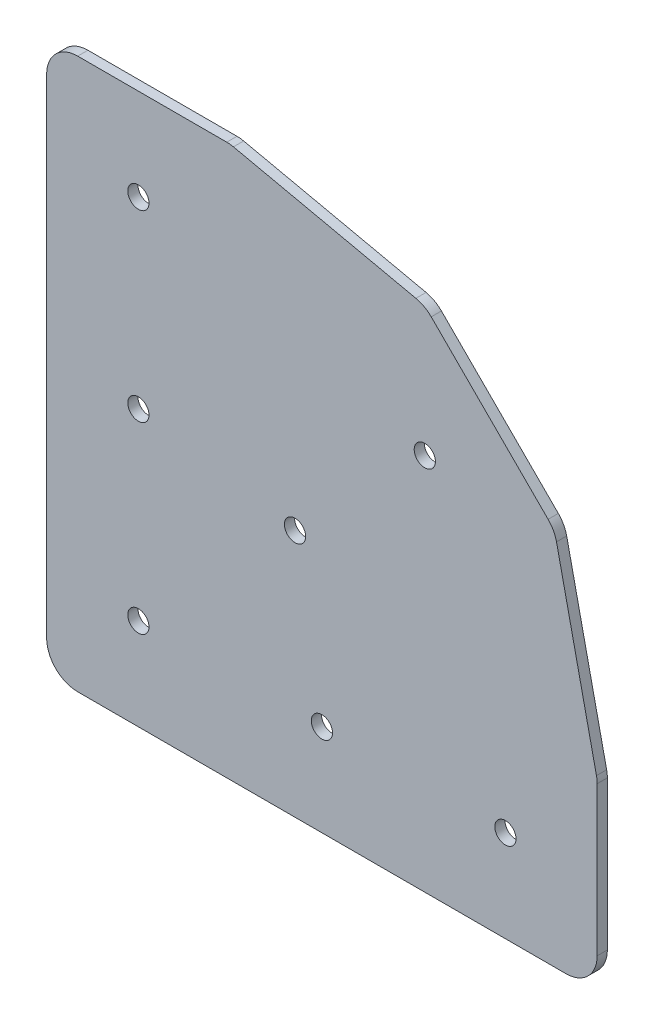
ISO-10303-21;
HEADER;
FILE_DESCRIPTION(('STEP AP214'),'2;1');
FILE_NAME('part.step','',(''),(''),'','','');
FILE_SCHEMA(('AUTOMOTIVE_DESIGN { 1 0 10303 214 1 1 1 1 }'));
ENDSEC;
DATA;
#1=APPLICATION_CONTEXT('core data for automotive mechanical design processes');
#2=APPLICATION_PROTOCOL_DEFINITION('international standard','automotive_design',2000,#1);
#3=PRODUCT_CONTEXT('',#1,'mechanical');
#4=PRODUCT('Part','Part','',(#3));
#5=PRODUCT_RELATED_PRODUCT_CATEGORY('part','',(#4));
#6=PRODUCT_DEFINITION_FORMATION('','',#4);
#7=PRODUCT_DEFINITION_CONTEXT('part definition',#1,'design');
#8=PRODUCT_DEFINITION('design','',#6,#7);
#9=PRODUCT_DEFINITION_SHAPE('','',#8);
#10=(LENGTH_UNIT() NAMED_UNIT(*) SI_UNIT(.MILLI.,.METRE.));
#11=(NAMED_UNIT(*) PLANE_ANGLE_UNIT() SI_UNIT($,.RADIAN.));
#12=(NAMED_UNIT(*) SI_UNIT($,.STERADIAN.) SOLID_ANGLE_UNIT());
#13=UNCERTAINTY_MEASURE_WITH_UNIT(LENGTH_MEASURE(1.E-05),#10,'distance_accuracy_value','');
#14=(GEOMETRIC_REPRESENTATION_CONTEXT(3) GLOBAL_UNCERTAINTY_ASSIGNED_CONTEXT((#13)) GLOBAL_UNIT_ASSIGNED_CONTEXT((#10,
#11,#12)) REPRESENTATION_CONTEXT('',''));
#15=CARTESIAN_POINT('',(0.,0.,0.));
#16=DIRECTION('',(0.,0.,1.));
#17=DIRECTION('',(1.,0.,0.));
#18=AXIS2_PLACEMENT_3D('',#15,#16,#17);
#19=CARTESIAN_POINT('',(4.841875,0.,0.));
#20=DIRECTION('',(0.,1.,0.));
#21=DIRECTION('',(0.,0.,1.));
#22=AXIS2_PLACEMENT_3D('',#19,#20,#21);
#23=PLANE('',#22);
#24=DIRECTION('',(0.,0.,-1.));
#25=VECTOR('',#24,1.);
#26=CARTESIAN_POINT('',(80.8831250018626,0.,0.79375));
#27=LINE('',#26,#25);
#28=CARTESIAN_POINT('',(80.8831250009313,0.,0.));
#29=VERTEX_POINT('',#28);
#30=CARTESIAN_POINT('',(80.8831250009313,0.,1.5875));
#31=VERTEX_POINT('',#30);
#32=EDGE_CURVE('E178',#29,#31,#27,.F.);
#33=ORIENTED_EDGE('',*,*,#32,.T.);
#34=DIRECTION('',(1.,0.,0.));
#35=VECTOR('',#34,1.);
#36=CARTESIAN_POINT('',(42.8625,0.,1.5875));
#37=LINE('',#36,#35);
#38=CARTESIAN_POINT('',(4.84187500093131,0.,1.5875));
#39=VERTEX_POINT('',#38);
#40=EDGE_CURVE('E222',#39,#31,#37,.T.);
#41=ORIENTED_EDGE('',*,*,#40,.F.);
#42=DIRECTION('',(0.,0.,1.));
#43=VECTOR('',#42,1.);
#44=CARTESIAN_POINT('',(4.84187500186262,0.,0.79375));
#45=LINE('',#44,#43);
#46=CARTESIAN_POINT('',(4.84187500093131,0.,0.));
#47=VERTEX_POINT('',#46);
#48=EDGE_CURVE('E142',#39,#47,#45,.F.);
#49=ORIENTED_EDGE('',*,*,#48,.T.);
#50=DIRECTION('',(1.,0.,0.));
#51=VECTOR('',#50,1.);
#52=CARTESIAN_POINT('',(42.8625,0.,0.));
#53=LINE('',#52,#51);
#54=EDGE_CURVE('E245',#47,#29,#53,.T.);
#55=ORIENTED_EDGE('',*,*,#54,.T.);
#56=EDGE_LOOP('',(#33,#41,#49,#55));
#57=FACE_BOUND('',#56,.T.);
#58=ADVANCED_FACE('F16',(#57),#23,.F.);
#59=CARTESIAN_POINT('',(80.883125,4.841875,1.5875));
#60=DIRECTION('',(0.,0.,-1.));
#61=DIRECTION('',(0.,1.,0.));
#62=AXIS2_PLACEMENT_3D('',#59,#60,#61);
#63=CYLINDRICAL_SURFACE('',#62,4.84187500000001);
#64=ORIENTED_EDGE('',*,*,#32,.F.);
#65=CARTESIAN_POINT('',(80.883125,4.841875,0.));
#66=DIRECTION('',(0.,0.,-1.));
#67=DIRECTION('',(0.,1.,0.));
#68=AXIS2_PLACEMENT_3D('',#65,#66,#67);
#69=CIRCLE('',#68,4.84187500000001);
#70=CARTESIAN_POINT('',(85.725,4.841875,0.));
#71=VERTEX_POINT('',#70);
#72=EDGE_CURVE('E242',#29,#71,#69,.F.);
#73=ORIENTED_EDGE('',*,*,#72,.T.);
#74=DIRECTION('',(0.,0.,1.));
#75=VECTOR('',#74,1.);
#76=CARTESIAN_POINT('',(85.725,4.841875,0.79375));
#77=LINE('',#76,#75);
#78=CARTESIAN_POINT('',(85.725,4.841875,1.5875));
#79=VERTEX_POINT('',#78);
#80=EDGE_CURVE('E175',#71,#79,#77,.T.);
#81=ORIENTED_EDGE('',*,*,#80,.T.);
#82=CARTESIAN_POINT('',(80.883125,4.841875,1.5875));
#83=DIRECTION('',(0.,0.,-1.));
#84=DIRECTION('',(0.,1.,0.));
#85=AXIS2_PLACEMENT_3D('',#82,#83,#84);
#86=CIRCLE('',#85,4.84187500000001);
#87=EDGE_CURVE('E220',#31,#79,#86,.F.);
#88=ORIENTED_EDGE('',*,*,#87,.F.);
#89=EDGE_LOOP('',(#64,#73,#81,#88));
#90=FACE_BOUND('',#89,.T.);
#91=ADVANCED_FACE('F360',(#90),#63,.T.);
#92=CARTESIAN_POINT('',(85.725,4.841875,0.));
#93=DIRECTION('',(-1.,0.,0.));
#94=DIRECTION('',(0.,0.,1.));
#95=AXIS2_PLACEMENT_3D('',#92,#93,#94);
#96=PLANE('',#95);
#97=ORIENTED_EDGE('',*,*,#80,.F.);
#98=DIRECTION('',(0.,1.,0.));
#99=VECTOR('',#98,1.);
#100=CARTESIAN_POINT('',(85.725,42.8625,0.));
#101=LINE('',#100,#99);
#102=CARTESIAN_POINT('',(85.725,28.0511372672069,0.));
#103=VERTEX_POINT('',#102);
#104=EDGE_CURVE('E241',#71,#103,#101,.T.);
#105=ORIENTED_EDGE('',*,*,#104,.T.);
#106=DIRECTION('',(0.,0.,-1.));
#107=VECTOR('',#106,1.);
#108=CARTESIAN_POINT('',(85.725,28.0511372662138,0.79375));
#109=LINE('',#108,#107);
#110=CARTESIAN_POINT('',(85.725,28.0511372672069,1.5875));
#111=VERTEX_POINT('',#110);
#112=EDGE_CURVE('E116',#103,#111,#109,.F.);
#113=ORIENTED_EDGE('',*,*,#112,.T.);
#114=DIRECTION('',(0.,1.,0.));
#115=VECTOR('',#114,1.);
#116=CARTESIAN_POINT('',(85.725,42.8625,1.5875));
#117=LINE('',#116,#115);
#118=EDGE_CURVE('E219',#79,#111,#117,.T.);
#119=ORIENTED_EDGE('',*,*,#118,.F.);
#120=EDGE_LOOP('',(#97,#105,#113,#119));
#121=FACE_BOUND('',#120,.T.);
#122=ADVANCED_FACE('F273',(#121),#96,.F.);
#123=CARTESIAN_POINT('',(80.883125,28.0511372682,1.5875));
#124=DIRECTION('',(0.,0.,-1.));
#125=DIRECTION('',(0.,1.,0.));
#126=AXIS2_PLACEMENT_3D('',#123,#124,#125);
#127=CYLINDRICAL_SURFACE('',#126,4.84187500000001);
#128=ORIENTED_EDGE('',*,*,#112,.F.);
#129=CARTESIAN_POINT('',(80.883125,28.0511372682,0.));
#130=DIRECTION('',(0.,0.,-1.));
#131=DIRECTION('',(0.,1.,0.));
#132=AXIS2_PLACEMENT_3D('',#129,#130,#131);
#133=CIRCLE('',#132,4.84187500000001);
#134=CARTESIAN_POINT('',(85.6129537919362,29.0867399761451,0.));
#135=VERTEX_POINT('',#134);
#136=EDGE_CURVE('E20',#103,#135,#133,.F.);
#137=ORIENTED_EDGE('',*,*,#136,.T.);
#138=DIRECTION('',(0.,0.,1.));
#139=VECTOR('',#138,1.);
#140=CARTESIAN_POINT('',(85.6129537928,29.0867399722,0.79375));
#141=LINE('',#140,#139);
#142=CARTESIAN_POINT('',(85.6129538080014,29.086739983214,1.5875));
#143=VERTEX_POINT('',#142);
#144=EDGE_CURVE('E123',#135,#143,#141,.T.);
#145=ORIENTED_EDGE('',*,*,#144,.T.);
#146=CARTESIAN_POINT('',(80.883125,28.0511372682,1.5875));
#147=DIRECTION('',(0.,0.,-1.));
#148=DIRECTION('',(0.,1.,0.));
#149=AXIS2_PLACEMENT_3D('',#146,#147,#148);
#150=CIRCLE('',#149,4.84187500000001);
#151=EDGE_CURVE('E217',#111,#143,#150,.F.);
#152=ORIENTED_EDGE('',*,*,#151,.F.);
#153=EDGE_LOOP('',(#128,#137,#145,#152));
#154=FACE_BOUND('',#153,.T.);
#155=ADVANCED_FACE('F140',(#154),#127,.T.);
#156=CARTESIAN_POINT('',(79.3922616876,57.4980296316,0.));
#157=DIRECTION('',(-0.976858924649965,-0.213884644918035,0.));
#158=DIRECTION('',(0.213884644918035,-0.976858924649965,0.));
#159=AXIS2_PLACEMENT_3D('',#156,#157,#158);
#160=PLANE('',#159);
#161=ORIENTED_EDGE('',*,*,#144,.F.);
#162=DIRECTION('',(0.213884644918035,-0.976858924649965,0.));
#163=VECTOR('',#162,1.);
#164=CARTESIAN_POINT('',(79.3922616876,57.4980296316,0.));
#165=LINE('',#164,#163);
#166=CARTESIAN_POINT('',(79.3922616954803,57.4980296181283,0.));
#167=VERTEX_POINT('',#166);
#168=EDGE_CURVE('E127',#135,#167,#165,.F.);
#169=ORIENTED_EDGE('',*,*,#168,.T.);
#170=DIRECTION('',(0.,0.,-1.));
#171=VECTOR('',#170,1.);
#172=CARTESIAN_POINT('',(79.3922616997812,57.4980296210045,0.79375));
#173=LINE('',#172,#171);
#174=CARTESIAN_POINT('',(79.3922616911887,57.4980296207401,1.5875));
#175=VERTEX_POINT('',#174);
#176=EDGE_CURVE('E129',#167,#175,#173,.F.);
#177=ORIENTED_EDGE('',*,*,#176,.T.);
#178=DIRECTION('',(-0.213884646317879,0.976858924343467,0.));
#179=VECTOR('',#178,1.);
#180=CARTESIAN_POINT('',(85.61295382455,29.086739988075,1.5875));
#181=LINE('',#180,#179);
#182=EDGE_CURVE('E128',#143,#175,#181,.T.);
#183=ORIENTED_EDGE('',*,*,#182,.F.);
#184=EDGE_LOOP('',(#161,#169,#177,#183));
#185=FACE_BOUND('',#184,.T.);
#186=ADVANCED_FACE('F125',(#185),#160,.F.);
#187=CARTESIAN_POINT('',(74.6624328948,56.4624269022,1.5875));
#188=DIRECTION('',(0.,0.,-1.));
#189=DIRECTION('',(0.,1.,0.));
#190=AXIS2_PLACEMENT_3D('',#187,#188,#189);
#191=CYLINDRICAL_SURFACE('',#190,4.84187499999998);
#192=ORIENTED_EDGE('',*,*,#176,.F.);
#193=CARTESIAN_POINT('',(74.6624328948,56.4624269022,0.));
#194=DIRECTION('',(0.,0.,-1.));
#195=DIRECTION('',(0.,1.,0.));
#196=AXIS2_PLACEMENT_3D('',#193,#194,#195);
#197=CIRCLE('',#196,4.84187499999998);
#198=CARTESIAN_POINT('',(78.0861555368,59.8861495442,0.));
#199=VERTEX_POINT('',#198);
#200=EDGE_CURVE('E139',#167,#199,#197,.F.);
#201=ORIENTED_EDGE('',*,*,#200,.T.);
#202=DIRECTION('',(0.,0.,1.));
#203=VECTOR('',#202,1.);
#204=CARTESIAN_POINT('',(78.0861555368,59.8861495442,0.79375));
#205=LINE('',#204,#203);
#206=CARTESIAN_POINT('',(78.086155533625,59.886149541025,1.5875));
#207=VERTEX_POINT('',#206);
#208=EDGE_CURVE('E170',#199,#207,#205,.T.);
#209=ORIENTED_EDGE('',*,*,#208,.T.);
#210=CARTESIAN_POINT('',(74.6624328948,56.4624269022,1.5875));
#211=DIRECTION('',(0.,0.,-1.));
#212=DIRECTION('',(0.,1.,0.));
#213=AXIS2_PLACEMENT_3D('',#210,#211,#212);
#214=CIRCLE('',#213,4.84187499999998);
#215=EDGE_CURVE('E214',#175,#207,#214,.F.);
#216=ORIENTED_EDGE('',*,*,#215,.F.);
#217=EDGE_LOOP('',(#192,#201,#209,#216));
#218=FACE_BOUND('',#217,.T.);
#219=ADVANCED_FACE('F266',(#218),#191,.T.);
#220=CARTESIAN_POINT('',(59.8861495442,78.0861555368,0.));
#221=DIRECTION('',(-0.707106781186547,-0.707106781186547,0.));
#222=DIRECTION('',(0.707106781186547,-0.707106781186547,0.));
#223=AXIS2_PLACEMENT_3D('',#220,#221,#222);
#224=PLANE('',#223);
#225=ORIENTED_EDGE('',*,*,#208,.F.);
#226=DIRECTION('',(0.707106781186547,-0.707106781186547,0.));
#227=VECTOR('',#226,1.);
#228=CARTESIAN_POINT('',(59.8861495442,78.0861555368,0.));
#229=LINE('',#228,#227);
#230=CARTESIAN_POINT('',(59.8861495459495,78.0861555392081,0.));
#231=VERTEX_POINT('',#230);
#232=EDGE_CURVE('E262',#199,#231,#229,.F.);
#233=ORIENTED_EDGE('',*,*,#232,.T.);
#234=DIRECTION('',(0.,0.,-1.));
#235=VECTOR('',#234,1.);
#236=CARTESIAN_POINT('',(59.8861495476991,78.0861555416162,0.79375));
#237=LINE('',#236,#235);
#238=CARTESIAN_POINT('',(59.8861495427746,78.0861555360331,1.5875));
#239=VERTEX_POINT('',#238);
#240=EDGE_CURVE('E167',#231,#239,#237,.F.);
#241=ORIENTED_EDGE('',*,*,#240,.T.);
#242=DIRECTION('',(-0.707106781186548,0.707106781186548,0.));
#243=VECTOR('',#242,1.);
#244=CARTESIAN_POINT('',(78.08615549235,59.88614957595,1.5875));
#245=LINE('',#244,#243);
#246=EDGE_CURVE('E212',#207,#239,#245,.T.);
#247=ORIENTED_EDGE('',*,*,#246,.F.);
#248=EDGE_LOOP('',(#225,#233,#241,#247));
#249=FACE_BOUND('',#248,.T.);
#250=ADVANCED_FACE('F304',(#249),#224,.F.);
#251=CARTESIAN_POINT('',(56.4624269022,74.6624328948,1.5875));
#252=DIRECTION('',(0.,0.,-1.));
#253=DIRECTION('',(0.,1.,0.));
#254=AXIS2_PLACEMENT_3D('',#251,#252,#253);
#255=CYLINDRICAL_SURFACE('',#254,4.84187500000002);
#256=ORIENTED_EDGE('',*,*,#240,.F.);
#257=CARTESIAN_POINT('',(56.4624269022,74.6624328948,0.));
#258=DIRECTION('',(0.,0.,-1.));
#259=DIRECTION('',(0.,1.,0.));
#260=AXIS2_PLACEMENT_3D('',#257,#258,#259);
#261=CIRCLE('',#260,4.84187500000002);
#262=CARTESIAN_POINT('',(57.4980296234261,79.3922616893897,0.));
#263=VERTEX_POINT('',#262);
#264=EDGE_CURVE('E259',#231,#263,#261,.F.);
#265=ORIENTED_EDGE('',*,*,#264,.T.);
#266=DIRECTION('',(0.,0.,1.));
#267=VECTOR('',#266,1.);
#268=CARTESIAN_POINT('',(57.4980296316,79.3922616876,0.79375));
#269=LINE('',#268,#267);
#270=CARTESIAN_POINT('',(57.4980296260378,79.3922616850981,1.5875));
#271=VERTEX_POINT('',#270);
#272=EDGE_CURVE('E164',#263,#271,#269,.T.);
#273=ORIENTED_EDGE('',*,*,#272,.T.);
#274=CARTESIAN_POINT('',(56.4624269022,74.6624328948,1.5875));
#275=DIRECTION('',(0.,0.,-1.));
#276=DIRECTION('',(0.,1.,0.));
#277=AXIS2_PLACEMENT_3D('',#274,#275,#276);
#278=CIRCLE('',#277,4.84187500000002);
#279=EDGE_CURVE('E210',#239,#271,#278,.F.);
#280=ORIENTED_EDGE('',*,*,#279,.F.);
#281=EDGE_LOOP('',(#256,#265,#273,#280));
#282=FACE_BOUND('',#281,.T.);
#283=ADVANCED_FACE('F301',(#282),#255,.T.);
#284=CARTESIAN_POINT('',(29.0867399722,85.6129537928,0.));
#285=DIRECTION('',(-0.213884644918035,-0.976858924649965,0.));
#286=DIRECTION('',(0.976858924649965,-0.213884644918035,0.));
#287=AXIS2_PLACEMENT_3D('',#284,#285,#286);
#288=PLANE('',#287);
#289=ORIENTED_EDGE('',*,*,#272,.F.);
#290=DIRECTION('',(0.976858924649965,-0.213884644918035,0.));
#291=VECTOR('',#290,1.);
#292=CARTESIAN_POINT('',(29.0867399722,85.6129537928,0.));
#293=LINE('',#292,#291);
#294=CARTESIAN_POINT('',(29.0867399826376,85.612953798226,0.));
#295=VERTEX_POINT('',#294);
#296=EDGE_CURVE('E256',#263,#295,#293,.F.);
#297=ORIENTED_EDGE('',*,*,#296,.T.);
#298=DIRECTION('',(0.,0.,-1.));
#299=VECTOR('',#298,1.);
#300=CARTESIAN_POINT('',(29.086739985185,85.6129538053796,0.79375));
#301=LINE('',#300,#299);
#302=CARTESIAN_POINT('',(29.0867399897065,85.6129538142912,1.5875));
#303=VERTEX_POINT('',#302);
#304=EDGE_CURVE('E161',#295,#303,#301,.F.);
#305=ORIENTED_EDGE('',*,*,#304,.T.);
#306=DIRECTION('',(-0.976858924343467,0.213884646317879,0.));
#307=VECTOR('',#306,1.);
#308=CARTESIAN_POINT('',(57.498029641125,79.392261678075,1.5875));
#309=LINE('',#308,#307);
#310=EDGE_CURVE('E208',#271,#303,#309,.T.);
#311=ORIENTED_EDGE('',*,*,#310,.F.);
#312=EDGE_LOOP('',(#289,#297,#305,#311));
#313=FACE_BOUND('',#312,.T.);
#314=ADVANCED_FACE('F298',(#313),#288,.F.);
#315=CARTESIAN_POINT('',(28.0511372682,80.883125,1.5875));
#316=DIRECTION('',(0.,0.,-1.));
#317=DIRECTION('',(0.,1.,0.));
#318=AXIS2_PLACEMENT_3D('',#315,#316,#317);
#319=CYLINDRICAL_SURFACE('',#318,4.841875);
#320=ORIENTED_EDGE('',*,*,#304,.F.);
#321=CARTESIAN_POINT('',(28.0511372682,80.883125,0.));
#322=DIRECTION('',(0.,0.,-1.));
#323=DIRECTION('',(0.,1.,0.));
#324=AXIS2_PLACEMENT_3D('',#321,#322,#323);
#325=CIRCLE('',#324,4.841875);
#326=CARTESIAN_POINT('',(28.0511372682,85.725,0.));
#327=VERTEX_POINT('',#326);
#328=EDGE_CURVE('E253',#295,#327,#325,.F.);
#329=ORIENTED_EDGE('',*,*,#328,.T.);
#330=DIRECTION('',(0.,0.,1.));
#331=VECTOR('',#330,1.);
#332=CARTESIAN_POINT('',(28.0511372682,85.725,0.79375));
#333=LINE('',#332,#331);
#334=CARTESIAN_POINT('',(28.0511372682,85.725,1.5875));
#335=VERTEX_POINT('',#334);
#336=EDGE_CURVE('E158',#327,#335,#333,.T.);
#337=ORIENTED_EDGE('',*,*,#336,.T.);
#338=CARTESIAN_POINT('',(28.0511372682,80.883125,1.5875));
#339=DIRECTION('',(0.,0.,-1.));
#340=DIRECTION('',(0.,1.,0.));
#341=AXIS2_PLACEMENT_3D('',#338,#339,#340);
#342=CIRCLE('',#341,4.841875);
#343=EDGE_CURVE('E206',#303,#335,#342,.F.);
#344=ORIENTED_EDGE('',*,*,#343,.F.);
#345=EDGE_LOOP('',(#320,#329,#337,#344));
#346=FACE_BOUND('',#345,.T.);
#347=ADVANCED_FACE('F294',(#346),#319,.T.);
#348=CARTESIAN_POINT('',(4.841875,85.725,1.5875));
#349=DIRECTION('',(0.,-1.,0.));
#350=DIRECTION('',(0.,0.,-1.));
#351=AXIS2_PLACEMENT_3D('',#348,#349,#350);
#352=PLANE('',#351);
#353=ORIENTED_EDGE('',*,*,#336,.F.);
#354=DIRECTION('',(-1.,0.,0.));
#355=VECTOR('',#354,1.);
#356=CARTESIAN_POINT('',(42.8625,85.725,0.));
#357=LINE('',#356,#355);
#358=CARTESIAN_POINT('',(4.84187500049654,85.725,0.));
#359=VERTEX_POINT('',#358);
#360=EDGE_CURVE('E150',#327,#359,#357,.T.);
#361=ORIENTED_EDGE('',*,*,#360,.T.);
#362=DIRECTION('',(0.,0.,-1.));
#363=VECTOR('',#362,1.);
#364=CARTESIAN_POINT('',(4.84187500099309,85.725,0.79375));
#365=LINE('',#364,#363);
#366=CARTESIAN_POINT('',(4.84187500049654,85.725,1.5875));
#367=VERTEX_POINT('',#366);
#368=EDGE_CURVE('E155',#359,#367,#365,.F.);
#369=ORIENTED_EDGE('',*,*,#368,.T.);
#370=DIRECTION('',(-1.,0.,0.));
#371=VECTOR('',#370,1.);
#372=CARTESIAN_POINT('',(42.8625,85.725,1.5875));
#373=LINE('',#372,#371);
#374=EDGE_CURVE('E205',#335,#367,#373,.T.);
#375=ORIENTED_EDGE('',*,*,#374,.F.);
#376=EDGE_LOOP('',(#353,#361,#369,#375));
#377=FACE_BOUND('',#376,.T.);
#378=ADVANCED_FACE('F290',(#377),#352,.F.);
#379=CARTESIAN_POINT('',(4.841875,80.883125,1.5875));
#380=DIRECTION('',(0.,0.,-1.));
#381=DIRECTION('',(0.,1.,0.));
#382=AXIS2_PLACEMENT_3D('',#379,#380,#381);
#383=CYLINDRICAL_SURFACE('',#382,4.841875);
#384=ORIENTED_EDGE('',*,*,#368,.F.);
#385=CARTESIAN_POINT('',(4.841875,80.883125,0.));
#386=DIRECTION('',(0.,0.,-1.));
#387=DIRECTION('',(0.,1.,0.));
#388=AXIS2_PLACEMENT_3D('',#385,#386,#387);
#389=CIRCLE('',#388,4.841875);
#390=CARTESIAN_POINT('',(0.,80.883125,0.));
#391=VERTEX_POINT('',#390);
#392=EDGE_CURVE('E250',#359,#391,#389,.F.);
#393=ORIENTED_EDGE('',*,*,#392,.T.);
#394=DIRECTION('',(0.,0.,1.));
#395=VECTOR('',#394,1.);
#396=CARTESIAN_POINT('',(0.,80.883125,0.79375));
#397=LINE('',#396,#395);
#398=CARTESIAN_POINT('',(0.,80.883125,1.5875));
#399=VERTEX_POINT('',#398);
#400=EDGE_CURVE('E147',#391,#399,#397,.T.);
#401=ORIENTED_EDGE('',*,*,#400,.T.);
#402=CARTESIAN_POINT('',(4.841875,80.883125,1.5875));
#403=DIRECTION('',(0.,0.,-1.));
#404=DIRECTION('',(0.,1.,0.));
#405=AXIS2_PLACEMENT_3D('',#402,#403,#404);
#406=CIRCLE('',#405,4.841875);
#407=EDGE_CURVE('E203',#367,#399,#406,.F.);
#408=ORIENTED_EDGE('',*,*,#407,.F.);
#409=EDGE_LOOP('',(#384,#393,#401,#408));
#410=FACE_BOUND('',#409,.T.);
#411=ADVANCED_FACE('F286',(#410),#383,.T.);
#412=CARTESIAN_POINT('',(0.,4.841875,1.5875));
#413=DIRECTION('',(1.,0.,0.));
#414=DIRECTION('',(0.,0.,-1.));
#415=AXIS2_PLACEMENT_3D('',#412,#413,#414);
#416=PLANE('',#415);
#417=DIRECTION('',(0.,0.,-1.));
#418=VECTOR('',#417,1.);
#419=CARTESIAN_POINT('',(0.,4.84187499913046,0.79375));
#420=LINE('',#419,#418);
#421=CARTESIAN_POINT('',(0.,4.84187499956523,0.));
#422=VERTEX_POINT('',#421);
#423=CARTESIAN_POINT('',(0.,4.84187499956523,1.5875));
#424=VERTEX_POINT('',#423);
#425=EDGE_CURVE('E141',#422,#424,#420,.F.);
#426=ORIENTED_EDGE('',*,*,#425,.T.);
#427=DIRECTION('',(0.,-1.,0.));
#428=VECTOR('',#427,1.);
#429=CARTESIAN_POINT('',(0.,42.8625,1.5875));
#430=LINE('',#429,#428);
#431=EDGE_CURVE('E35',#399,#424,#430,.T.);
#432=ORIENTED_EDGE('',*,*,#431,.F.);
#433=ORIENTED_EDGE('',*,*,#400,.F.);
#434=DIRECTION('',(0.,-1.,0.));
#435=VECTOR('',#434,1.);
#436=CARTESIAN_POINT('',(0.,42.8625,0.));
#437=LINE('',#436,#435);
#438=EDGE_CURVE('E249',#391,#422,#437,.T.);
#439=ORIENTED_EDGE('',*,*,#438,.T.);
#440=EDGE_LOOP('',(#426,#432,#433,#439));
#441=FACE_BOUND('',#440,.T.);
#442=ADVANCED_FACE('F279',(#441),#416,.F.);
#443=CARTESIAN_POINT('',(4.841875,4.841875,1.5875));
#444=DIRECTION('',(0.,0.,-1.));
#445=DIRECTION('',(0.,1.,0.));
#446=AXIS2_PLACEMENT_3D('',#443,#444,#445);
#447=CYLINDRICAL_SURFACE('',#446,4.841875);
#448=ORIENTED_EDGE('',*,*,#425,.F.);
#449=CARTESIAN_POINT('',(4.841875,4.841875,0.));
#450=DIRECTION('',(0.,0.,-1.));
#451=DIRECTION('',(0.,1.,0.));
#452=AXIS2_PLACEMENT_3D('',#449,#450,#451);
#453=CIRCLE('',#452,4.841875);
#454=EDGE_CURVE('E246',#422,#47,#453,.F.);
#455=ORIENTED_EDGE('',*,*,#454,.T.);
#456=ORIENTED_EDGE('',*,*,#48,.F.);
#457=CARTESIAN_POINT('',(4.841875,4.841875,1.5875));
#458=DIRECTION('',(0.,0.,-1.));
#459=DIRECTION('',(0.,1.,0.));
#460=AXIS2_PLACEMENT_3D('',#457,#458,#459);
#461=CIRCLE('',#460,4.841875);
#462=EDGE_CURVE('E201',#424,#39,#461,.F.);
#463=ORIENTED_EDGE('',*,*,#462,.F.);
#464=EDGE_LOOP('',(#448,#455,#456,#463));
#465=FACE_BOUND('',#464,.T.);
#466=ADVANCED_FACE('F349',(#465),#447,.T.);
#467=CARTESIAN_POINT('',(58.8833644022,58.8833644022,0.));
#468=DIRECTION('',(0.,0.,1.));
#469=DIRECTION('',(1.,0.,0.));
#470=AXIS2_PLACEMENT_3D('',#467,#468,#469);
#471=CYLINDRICAL_SURFACE('',#470,1.65100000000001);
#472=CARTESIAN_POINT('',(58.8833644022,58.8833644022,1.5875));
#473=DIRECTION('',(0.,0.,1.));
#474=DIRECTION('',(1.,0.,0.));
#475=AXIS2_PLACEMENT_3D('',#472,#473,#474);
#476=CIRCLE('',#475,1.65100000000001);
#477=CARTESIAN_POINT('',(60.5343644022,58.8833644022,1.5875));
#478=VERTEX_POINT('',#477);
#479=EDGE_CURVE('E198',#478,#478,#476,.F.);
#480=ORIENTED_EDGE('',*,*,#479,.F.);
#481=EDGE_LOOP('',(#480));
#482=FACE_BOUND('',#481,.T.);
#483=CARTESIAN_POINT('',(58.8833644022,58.8833644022,0.));
#484=DIRECTION('',(0.,0.,1.));
#485=DIRECTION('',(1.,0.,0.));
#486=AXIS2_PLACEMENT_3D('',#483,#484,#485);
#487=CIRCLE('',#486,1.65100000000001);
#488=CARTESIAN_POINT('',(60.5343644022,58.8833644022,0.));
#489=VERTEX_POINT('',#488);
#490=EDGE_CURVE('E238',#489,#489,#487,.F.);
#491=ORIENTED_EDGE('',*,*,#490,.T.);
#492=EDGE_LOOP('',(#491));
#493=FACE_BOUND('',#492,.T.);
#494=ADVANCED_FACE('F345',(#482,#493),#471,.F.);
#495=CARTESIAN_POINT('',(38.6777881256,38.6777881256,0.));
#496=DIRECTION('',(0.,0.,1.));
#497=DIRECTION('',(1.,0.,0.));
#498=AXIS2_PLACEMENT_3D('',#495,#496,#497);
#499=CYLINDRICAL_SURFACE('',#498,1.651);
#500=CARTESIAN_POINT('',(38.6777881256,38.6777881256,1.5875));
#501=DIRECTION('',(0.,0.,1.));
#502=DIRECTION('',(1.,0.,0.));
#503=AXIS2_PLACEMENT_3D('',#500,#501,#502);
#504=CIRCLE('',#503,1.651);
#505=CARTESIAN_POINT('',(40.3287881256,38.6777881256,1.5875));
#506=VERTEX_POINT('',#505);
#507=EDGE_CURVE('E195',#506,#506,#504,.F.);
#508=ORIENTED_EDGE('',*,*,#507,.F.);
#509=EDGE_LOOP('',(#508));
#510=FACE_BOUND('',#509,.T.);
#511=CARTESIAN_POINT('',(38.6777881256,38.6777881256,0.));
#512=DIRECTION('',(0.,0.,1.));
#513=DIRECTION('',(1.,0.,0.));
#514=AXIS2_PLACEMENT_3D('',#511,#512,#513);
#515=CIRCLE('',#514,1.651);
#516=CARTESIAN_POINT('',(40.3287881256,38.6777881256,0.));
#517=VERTEX_POINT('',#516);
#518=EDGE_CURVE('E235',#517,#517,#515,.F.);
#519=ORIENTED_EDGE('',*,*,#518,.T.);
#520=EDGE_LOOP('',(#519));
#521=FACE_BOUND('',#520,.T.);
#522=ADVANCED_FACE('F341',(#510,#521),#499,.F.);
#523=CARTESIAN_POINT('',(71.4375,14.2875,0.));
#524=DIRECTION('',(0.,0.,1.));
#525=DIRECTION('',(1.,0.,0.));
#526=AXIS2_PLACEMENT_3D('',#523,#524,#525);
#527=CYLINDRICAL_SURFACE('',#526,1.651);
#528=CARTESIAN_POINT('',(71.4375,14.2875,1.5875));
#529=DIRECTION('',(0.,0.,1.));
#530=DIRECTION('',(1.,0.,0.));
#531=AXIS2_PLACEMENT_3D('',#528,#529,#530);
#532=CIRCLE('',#531,1.651);
#533=CARTESIAN_POINT('',(73.0885,14.2875,1.5875));
#534=VERTEX_POINT('',#533);
#535=EDGE_CURVE('E192',#534,#534,#532,.F.);
#536=ORIENTED_EDGE('',*,*,#535,.F.);
#537=EDGE_LOOP('',(#536));
#538=FACE_BOUND('',#537,.T.);
#539=CARTESIAN_POINT('',(71.4375,14.2875,0.));
#540=DIRECTION('',(0.,0.,1.));
#541=DIRECTION('',(1.,0.,0.));
#542=AXIS2_PLACEMENT_3D('',#539,#540,#541);
#543=CIRCLE('',#542,1.651);
#544=CARTESIAN_POINT('',(73.0885,14.2875,0.));
#545=VERTEX_POINT('',#544);
#546=EDGE_CURVE('E232',#545,#545,#543,.F.);
#547=ORIENTED_EDGE('',*,*,#546,.T.);
#548=EDGE_LOOP('',(#547));
#549=FACE_BOUND('',#548,.T.);
#550=ADVANCED_FACE('F337',(#538,#549),#527,.F.);
#551=CARTESIAN_POINT('',(14.2875,14.2875,0.));
#552=DIRECTION('',(0.,0.,1.));
#553=DIRECTION('',(1.,0.,0.));
#554=AXIS2_PLACEMENT_3D('',#551,#552,#553);
#555=CYLINDRICAL_SURFACE('',#554,1.651);
#556=CARTESIAN_POINT('',(14.2875,14.2875,1.5875));
#557=DIRECTION('',(0.,0.,1.));
#558=DIRECTION('',(1.,0.,0.));
#559=AXIS2_PLACEMENT_3D('',#556,#557,#558);
#560=CIRCLE('',#559,1.651);
#561=CARTESIAN_POINT('',(15.9385,14.2875,1.5875));
#562=VERTEX_POINT('',#561);
#563=EDGE_CURVE('E189',#562,#562,#560,.F.);
#564=ORIENTED_EDGE('',*,*,#563,.F.);
#565=EDGE_LOOP('',(#564));
#566=FACE_BOUND('',#565,.T.);
#567=CARTESIAN_POINT('',(14.2875,14.2875,0.));
#568=DIRECTION('',(0.,0.,1.));
#569=DIRECTION('',(1.,0.,0.));
#570=AXIS2_PLACEMENT_3D('',#567,#568,#569);
#571=CIRCLE('',#570,1.651);
#572=CARTESIAN_POINT('',(15.9385,14.2875,0.));
#573=VERTEX_POINT('',#572);
#574=EDGE_CURVE('E229',#573,#573,#571,.F.);
#575=ORIENTED_EDGE('',*,*,#574,.T.);
#576=EDGE_LOOP('',(#575));
#577=FACE_BOUND('',#576,.T.);
#578=ADVANCED_FACE('F333',(#566,#577),#555,.F.);
#579=CARTESIAN_POINT('',(14.2875,42.8625,0.));
#580=DIRECTION('',(0.,0.,1.));
#581=DIRECTION('',(1.,0.,0.));
#582=AXIS2_PLACEMENT_3D('',#579,#580,#581);
#583=CYLINDRICAL_SURFACE('',#582,1.651);
#584=CARTESIAN_POINT('',(14.2875,42.8625,1.5875));
#585=DIRECTION('',(0.,0.,1.));
#586=DIRECTION('',(1.,0.,0.));
#587=AXIS2_PLACEMENT_3D('',#584,#585,#586);
#588=CIRCLE('',#587,1.651);
#589=CARTESIAN_POINT('',(15.9385,42.8625,1.5875));
#590=VERTEX_POINT('',#589);
#591=EDGE_CURVE('E186',#590,#590,#588,.F.);
#592=ORIENTED_EDGE('',*,*,#591,.F.);
#593=EDGE_LOOP('',(#592));
#594=FACE_BOUND('',#593,.T.);
#595=CARTESIAN_POINT('',(14.2875,42.8625,0.));
#596=DIRECTION('',(0.,0.,1.));
#597=DIRECTION('',(1.,0.,0.));
#598=AXIS2_PLACEMENT_3D('',#595,#596,#597);
#599=CIRCLE('',#598,1.651);
#600=CARTESIAN_POINT('',(15.9385,42.8625,0.));
#601=VERTEX_POINT('',#600);
#602=EDGE_CURVE('E226',#601,#601,#599,.F.);
#603=ORIENTED_EDGE('',*,*,#602,.T.);
#604=EDGE_LOOP('',(#603));
#605=FACE_BOUND('',#604,.T.);
#606=ADVANCED_FACE('F329',(#594,#605),#583,.F.);
#607=CARTESIAN_POINT('',(14.2875,71.4375,0.));
#608=DIRECTION('',(0.,0.,1.));
#609=DIRECTION('',(1.,0.,0.));
#610=AXIS2_PLACEMENT_3D('',#607,#608,#609);
#611=CYLINDRICAL_SURFACE('',#610,1.651);
#612=CARTESIAN_POINT('',(14.2875,71.4375,1.5875));
#613=DIRECTION('',(0.,0.,1.));
#614=DIRECTION('',(1.,0.,0.));
#615=AXIS2_PLACEMENT_3D('',#612,#613,#614);
#616=CIRCLE('',#615,1.651);
#617=CARTESIAN_POINT('',(15.9385,71.4375,1.5875));
#618=VERTEX_POINT('',#617);
#619=EDGE_CURVE('E183',#618,#618,#616,.F.);
#620=ORIENTED_EDGE('',*,*,#619,.F.);
#621=EDGE_LOOP('',(#620));
#622=FACE_BOUND('',#621,.T.);
#623=CARTESIAN_POINT('',(14.2875,71.4375,0.));
#624=DIRECTION('',(0.,0.,1.));
#625=DIRECTION('',(1.,0.,0.));
#626=AXIS2_PLACEMENT_3D('',#623,#624,#625);
#627=CIRCLE('',#626,1.651);
#628=CARTESIAN_POINT('',(15.9385,71.4375,0.));
#629=VERTEX_POINT('',#628);
#630=EDGE_CURVE('E223',#629,#629,#627,.F.);
#631=ORIENTED_EDGE('',*,*,#630,.T.);
#632=EDGE_LOOP('',(#631));
#633=FACE_BOUND('',#632,.T.);
#634=ADVANCED_FACE('F326',(#622,#633),#611,.F.);
#635=CARTESIAN_POINT('',(0.,0.,0.));
#636=DIRECTION('',(0.,0.,1.));
#637=DIRECTION('',(1.,0.,0.));
#638=AXIS2_PLACEMENT_3D('',#635,#636,#637);
#639=PLANE('',#638);
#640=ORIENTED_EDGE('',*,*,#630,.F.);
#641=EDGE_LOOP('',(#640));
#642=FACE_BOUND('',#641,.T.);
#643=ORIENTED_EDGE('',*,*,#602,.F.);
#644=EDGE_LOOP('',(#643));
#645=FACE_BOUND('',#644,.T.);
#646=ORIENTED_EDGE('',*,*,#574,.F.);
#647=EDGE_LOOP('',(#646));
#648=FACE_BOUND('',#647,.T.);
#649=ORIENTED_EDGE('',*,*,#546,.F.);
#650=EDGE_LOOP('',(#649));
#651=FACE_BOUND('',#650,.T.);
#652=ORIENTED_EDGE('',*,*,#518,.F.);
#653=EDGE_LOOP('',(#652));
#654=FACE_BOUND('',#653,.T.);
#655=ORIENTED_EDGE('',*,*,#490,.F.);
#656=EDGE_LOOP('',(#655));
#657=FACE_BOUND('',#656,.T.);
#658=CARTESIAN_POINT('',(42.8625,14.2875,0.));
#659=DIRECTION('',(0.,0.,1.));
#660=DIRECTION('',(1.,0.,0.));
#661=AXIS2_PLACEMENT_3D('',#658,#659,#660);
#662=CIRCLE('',#661,1.65100000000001);
#663=CARTESIAN_POINT('',(44.5135,14.2875,0.));
#664=VERTEX_POINT('',#663);
#665=EDGE_CURVE('E26',#664,#664,#662,.F.);
#666=ORIENTED_EDGE('',*,*,#665,.F.);
#667=EDGE_LOOP('',(#666));
#668=FACE_BOUND('',#667,.T.);
#669=ORIENTED_EDGE('',*,*,#72,.F.);
#670=ORIENTED_EDGE('',*,*,#54,.F.);
#671=ORIENTED_EDGE('',*,*,#454,.F.);
#672=ORIENTED_EDGE('',*,*,#438,.F.);
#673=ORIENTED_EDGE('',*,*,#392,.F.);
#674=ORIENTED_EDGE('',*,*,#360,.F.);
#675=ORIENTED_EDGE('',*,*,#328,.F.);
#676=ORIENTED_EDGE('',*,*,#296,.F.);
#677=ORIENTED_EDGE('',*,*,#264,.F.);
#678=ORIENTED_EDGE('',*,*,#232,.F.);
#679=ORIENTED_EDGE('',*,*,#200,.F.);
#680=ORIENTED_EDGE('',*,*,#168,.F.);
#681=ORIENTED_EDGE('',*,*,#136,.F.);
#682=ORIENTED_EDGE('',*,*,#104,.F.);
#683=EDGE_LOOP('',(#669,#670,#671,#672,#673,#674,#675,#676,#677,#678,#679,#680,#681,#682));
#684=FACE_BOUND('',#683,.T.);
#685=ADVANCED_FACE('F134',(#642,#645,#648,#651,#654,#657,#668,#684),#639,.F.);
#686=CARTESIAN_POINT('',(0.,0.,1.5875));
#687=DIRECTION('',(0.,0.,1.));
#688=DIRECTION('',(1.,0.,0.));
#689=AXIS2_PLACEMENT_3D('',#686,#687,#688);
#690=PLANE('',#689);
#691=ORIENTED_EDGE('',*,*,#619,.T.);
#692=EDGE_LOOP('',(#691));
#693=FACE_BOUND('',#692,.T.);
#694=ORIENTED_EDGE('',*,*,#591,.T.);
#695=EDGE_LOOP('',(#694));
#696=FACE_BOUND('',#695,.T.);
#697=ORIENTED_EDGE('',*,*,#563,.T.);
#698=EDGE_LOOP('',(#697));
#699=FACE_BOUND('',#698,.T.);
#700=ORIENTED_EDGE('',*,*,#535,.T.);
#701=EDGE_LOOP('',(#700));
#702=FACE_BOUND('',#701,.T.);
#703=ORIENTED_EDGE('',*,*,#507,.T.);
#704=EDGE_LOOP('',(#703));
#705=FACE_BOUND('',#704,.T.);
#706=ORIENTED_EDGE('',*,*,#479,.T.);
#707=EDGE_LOOP('',(#706));
#708=FACE_BOUND('',#707,.T.);
#709=CARTESIAN_POINT('',(42.8625,14.2875,1.5875));
#710=DIRECTION('',(0.,0.,1.));
#711=DIRECTION('',(1.,0.,0.));
#712=AXIS2_PLACEMENT_3D('',#709,#710,#711);
#713=CIRCLE('',#712,1.65100000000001);
#714=CARTESIAN_POINT('',(44.5135,14.2875,1.5875));
#715=VERTEX_POINT('',#714);
#716=EDGE_CURVE('E10',#715,#715,#713,.T.);
#717=ORIENTED_EDGE('',*,*,#716,.F.);
#718=EDGE_LOOP('',(#717));
#719=FACE_BOUND('',#718,.T.);
#720=ORIENTED_EDGE('',*,*,#431,.T.);
#721=ORIENTED_EDGE('',*,*,#462,.T.);
#722=ORIENTED_EDGE('',*,*,#40,.T.);
#723=ORIENTED_EDGE('',*,*,#87,.T.);
#724=ORIENTED_EDGE('',*,*,#118,.T.);
#725=ORIENTED_EDGE('',*,*,#151,.T.);
#726=ORIENTED_EDGE('',*,*,#182,.T.);
#727=ORIENTED_EDGE('',*,*,#215,.T.);
#728=ORIENTED_EDGE('',*,*,#246,.T.);
#729=ORIENTED_EDGE('',*,*,#279,.T.);
#730=ORIENTED_EDGE('',*,*,#310,.T.);
#731=ORIENTED_EDGE('',*,*,#343,.T.);
#732=ORIENTED_EDGE('',*,*,#374,.T.);
#733=ORIENTED_EDGE('',*,*,#407,.T.);
#734=EDGE_LOOP('',(#720,#721,#722,#723,#724,#725,#726,#727,#728,#729,#730,#731,#732,#733));
#735=FACE_BOUND('',#734,.T.);
#736=ADVANCED_FACE('F18',(#693,#696,#699,#702,#705,#708,#719,#735),#690,.T.);
#737=CARTESIAN_POINT('',(42.8625,14.2875,0.));
#738=DIRECTION('',(0.,0.,1.));
#739=DIRECTION('',(1.,0.,0.));
#740=AXIS2_PLACEMENT_3D('',#737,#738,#739);
#741=CYLINDRICAL_SURFACE('',#740,1.65100000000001);
#742=ORIENTED_EDGE('',*,*,#665,.T.);
#743=EDGE_LOOP('',(#742));
#744=FACE_BOUND('',#743,.T.);
#745=ORIENTED_EDGE('',*,*,#716,.T.);
#746=EDGE_LOOP('',(#745));
#747=FACE_BOUND('',#746,.T.);
#748=ADVANCED_FACE('F316',(#744,#747),#741,.F.);
#749=CLOSED_SHELL('',(#58,#91,#122,#155,#186,#219,#250,#283,#314,#347,#378,#411,#442,#466,#494,
#522,#550,#578,#606,#634,#685,#736,#748));
#750=MANIFOLD_SOLID_BREP('B1',#749);
#751=ADVANCED_BREP_SHAPE_REPRESENTATION('',(#18,#750),#14);
#752=SHAPE_DEFINITION_REPRESENTATION(#9,#751);
ENDSEC;
END-ISO-10303-21;
